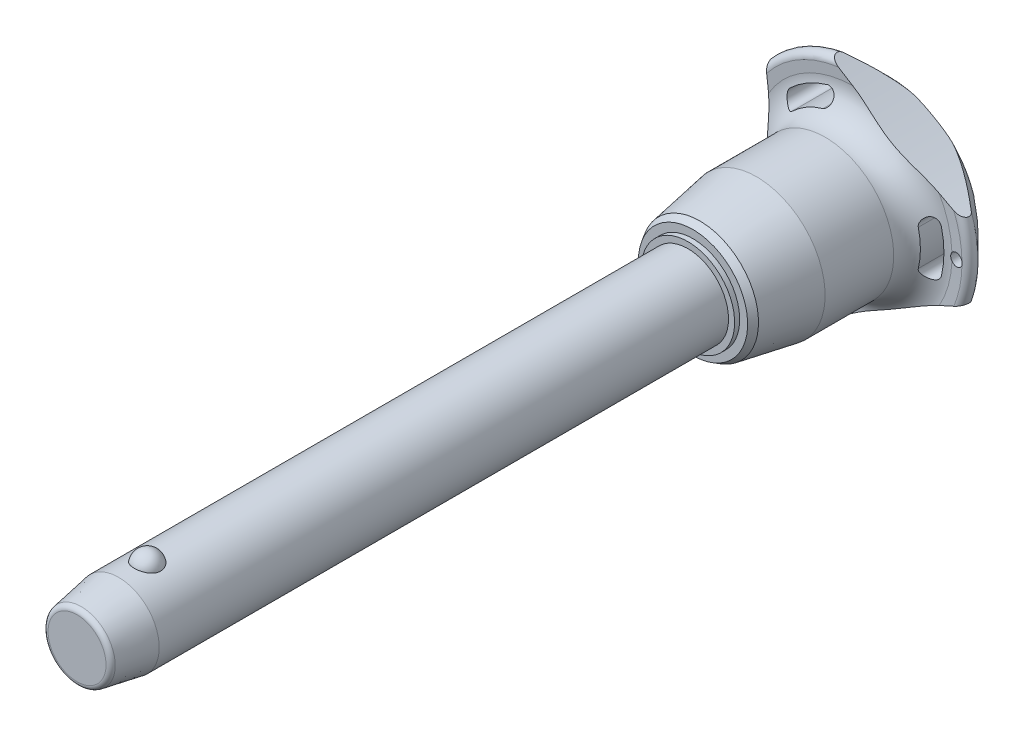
from build123d import *

# Parameters (mm, degrees)
SKETCH1_R           = 10
BOSS_EXTRUDE1_DEPTH = 130
SKETCH2_R           = 8.75
BOSS_EXTRUDE2_DEPTH = 50.7
BOSS_EXTRUDE3_START = 20.5
SKETCH1_2_R         = 10
BOSS_EXTRUDE3_DEPTH = 20.5
CHAMFER1_SIZE       = 10.25
CHAMFER1_SIZE2      = 1.807351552
FILLET1_R           = 1.25
SKETCH6_R           = 176.92625
CUT_EXTRUDE1_DEPTH  = 186.156340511
CIRPATTERN1_COUNT   = 3
SKETCH7_R           = 1.5
CUT_EXTRUDE2_DEPTH  = 186.074106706


with BuildPart() as part:
    # Sketch1 → Boss-Extrude1 (new body)
    with BuildSketch(Plane.XY):
        Circle(SKETCH1_R)
    extrude(amount=-BOSS_EXTRUDE1_DEPTH)

    # Sketch2 → Boss-Extrude2 (add)
    with BuildSketch(Plane(origin=(0, 0, -130), x_dir=(-1, 0, 0), z_dir=(0, 0, -1))):
        with Locations(Location((0, 0, 0), (0, 0, 180))):
            Circle(SKETCH2_R)
    extrude(amount=BOSS_EXTRUDE2_DEPTH)

    # Sketch3 → Revolve1 (revolve)
    with BuildSketch(Plane(origin=(0, 0, 0), x_dir=(0, 0, -1), z_dir=(1, 0, 0))):
        with BuildLine():
            Line((-3.201562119, 12.5), (-3.201562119, 5.9))
            ThreePointArc((-3.201562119, 5.9), (0.098437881, 9.2), (-3.201562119, 12.5))
        make_face()
        with BuildLine():
            Line((-3.201562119, -5.9), (-3.201562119, -12.5))
            ThreePointArc((-3.201562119, -12.5), (0.098437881, -9.2), (-3.201562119, -5.9))
        make_face()
    revolve(axis=Axis((0, -5.9, 3.201562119), (0, 1, 0)))

    # Sketch1_2 → Boss-Extrude3 (add)
    with BuildSketch(Plane.XY.offset(BOSS_EXTRUDE3_START)):
        Circle(SKETCH1_2_R)
    extrude(amount=-BOSS_EXTRUDE3_DEPTH)

    # Chamfer1
    chamfer1_edges = [part.edges().sort_by_distance(p)[0] for p in [
        (-10, 0, 20.5),
    ]]
    chamfer1_side = [part.faces().sort_by_distance(p)[0] for p in [
        (-10, 0, -54.75),
    ]]
    chamfer(chamfer1_edges, length=CHAMFER1_SIZE, length2=CHAMFER1_SIZE2, reference=chamfer1_side[0])

    # Fillet1
    fillet1_edges = [part.edges().sort_by_distance(p)[0] for p in [
        (-8.192648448, 0, 20.5),
        (-8.75, 0, -180.7),
    ]]
    fillet(fillet1_edges, radius=FILLET1_R)

    # Sketch4 → Revolve2 (revolve)
    with BuildSketch(Plane(origin=(0, 0, 0), x_dir=(0, 0, -1), z_dir=(1, 0, 0)), mode=Mode.PRIVATE) as revolve2_sk:
        Polygon((130, 0), (130, 11.504815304), (131.25, 11.504815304), (131.25, 13.461079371), (132.944174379, 14.439211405), (146.9, 16.9), (163.8, 16.9), (163.8, 0), align=None)
    revolve(revolve2_sk.sketch.rotate(Axis((0, 0, -163.8), (0, 0, 1)), 90), axis=Axis((0, 0, -163.8), (0, 0, 1)))

    # Sketch5 → Revolve3 (revolve)
    with BuildSketch(Plane(origin=(0, 0, 0), x_dir=(0, 0, -1), z_dir=(1, 0, 0)), mode=Mode.PRIVATE) as revolve3_sk:
        with BuildLine():
            Line((170.790129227, 24.271609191), (170.652256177, 26.865060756))
            ThreePointArc((170.652256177, 26.865060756), (171.598671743, 28.411427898), (173.38137085, 28.08137085))
            Line((173.38137085, 28.08137085), (179.763226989, 21.69951471))
            ThreePointArc((179.763226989, 21.69951471), (180.7, 19.381044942), (179.683055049, 17.096604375))
            ThreePointArc((179.683055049, 17.096604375), (174.18864484, 9.321268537), (172.25, 0))
            Line((172.25, 0), (163.8, 0))
            Line((163.8, 0), (163.8, 16.9))
            ThreePointArc((163.8, 16.9), (168.879432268, 19.083427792), (170.790129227, 24.271609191))
        make_face()
    revolve(revolve3_sk.sketch.rotate(Axis((0, 0, -172.25), (0, 0, 1)), 90), axis=Axis((0, 0, -172.25), (0, 0, 1)))

    # Sketch6 → Cut-Extrude1 (cut, through all)
    with BuildSketch(Plane.XY):
        with Locations((-197.42625, 0)):
            Circle(SKETCH6_R)
        with BuildLine():
            ThreePointArc((21.802992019, -5.260839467), (22.428706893, 0), (21.802992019, 5.260839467))
            ThreePointArc((21.802992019, 5.260839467), (19.579234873, 6.620060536), (18.220013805, 4.39630339))
            ThreePointArc((18.220013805, 4.39630339), (18.742902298, 0), (18.220013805, -4.39630339))
            ThreePointArc((18.220013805, -4.39630339), (19.579234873, -6.620060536), (21.802992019, -5.260839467))
        make_face()
    cut_extrude1 = extrude(amount=-CUT_EXTRUDE1_DEPTH, mode=Mode.SUBTRACT)

    # CirPattern1: Cut-Extrude1 ×3 about axis
    cirpattern1_axis = Axis((0, 0, 0), (0, 0, 1))
    for i in range(1, CIRPATTERN1_COUNT):
        add(cut_extrude1.rotate(cirpattern1_axis, i * 360 / CIRPATTERN1_COUNT), mode=Mode.SUBTRACT)

    # Sketch7 → Cut-Extrude2 (cut, through all)
    with BuildSketch(Plane.XY):
        with Locations(Location((25.428706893, 0, 0), (0, 0, 17.230769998))):
            Circle(SKETCH7_R)
    extrude(amount=-CUT_EXTRUDE2_DEPTH, mode=Mode.SUBTRACT)


solid = part.part
